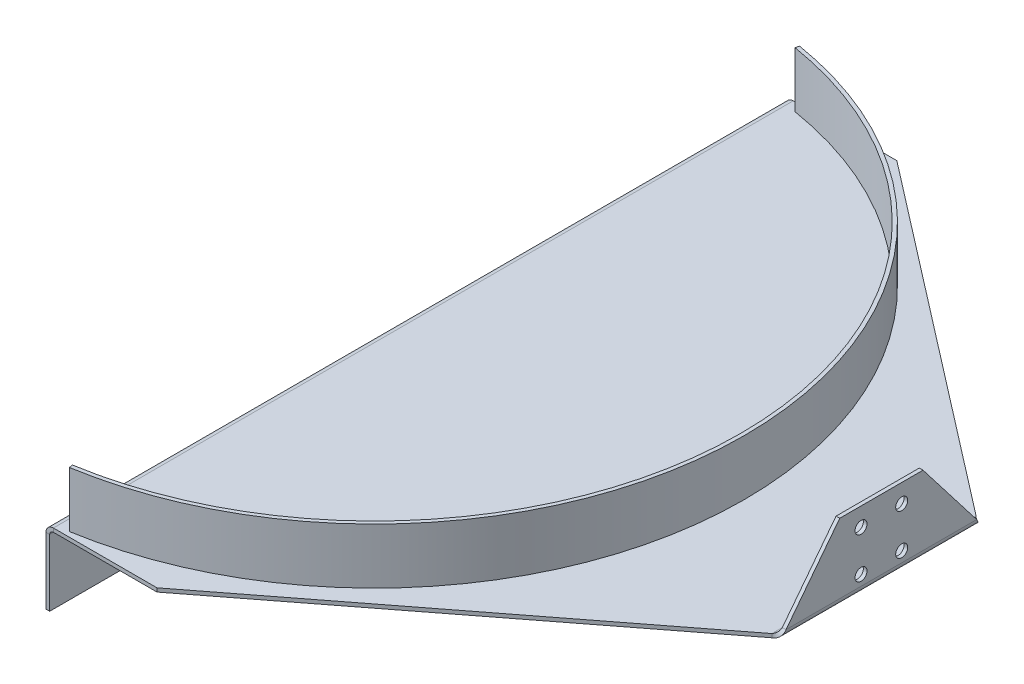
ISO-10303-21;
HEADER;
FILE_DESCRIPTION(('STEP AP214'),'2;1');
FILE_NAME('part.step','',(''),(''),'','','');
FILE_SCHEMA(('AUTOMOTIVE_DESIGN { 1 0 10303 214 1 1 1 1 }'));
ENDSEC;
DATA;
#1=APPLICATION_CONTEXT('core data for automotive mechanical design processes');
#2=APPLICATION_PROTOCOL_DEFINITION('international standard','automotive_design',2000,#1);
#3=PRODUCT_CONTEXT('',#1,'mechanical');
#4=PRODUCT('Part','Part','',(#3));
#5=PRODUCT_RELATED_PRODUCT_CATEGORY('part','',(#4));
#6=PRODUCT_DEFINITION_FORMATION('','',#4);
#7=PRODUCT_DEFINITION_CONTEXT('part definition',#1,'design');
#8=PRODUCT_DEFINITION('design','',#6,#7);
#9=PRODUCT_DEFINITION_SHAPE('','',#8);
#10=(LENGTH_UNIT() NAMED_UNIT(*) SI_UNIT(.MILLI.,.METRE.));
#11=(NAMED_UNIT(*) PLANE_ANGLE_UNIT() SI_UNIT($,.RADIAN.));
#12=(NAMED_UNIT(*) SI_UNIT($,.STERADIAN.) SOLID_ANGLE_UNIT());
#13=UNCERTAINTY_MEASURE_WITH_UNIT(LENGTH_MEASURE(1.E-05),#10,'distance_accuracy_value','');
#14=(GEOMETRIC_REPRESENTATION_CONTEXT(3) GLOBAL_UNCERTAINTY_ASSIGNED_CONTEXT((#13)) GLOBAL_UNIT_ASSIGNED_CONTEXT((#10,
#11,#12)) REPRESENTATION_CONTEXT('',''));
#15=CARTESIAN_POINT('',(0.,0.,0.));
#16=DIRECTION('',(0.,0.,1.));
#17=DIRECTION('',(1.,0.,0.));
#18=AXIS2_PLACEMENT_3D('',#15,#16,#17);
#19=CARTESIAN_POINT('',(0.,0.,200.));
#20=DIRECTION('',(0.,1.,0.));
#21=DIRECTION('',(0.,0.,1.));
#22=AXIS2_PLACEMENT_3D('',#19,#20,#21);
#23=PLANE('',#22);
#24=DIRECTION('',(0.,0.,1.));
#25=VECTOR('',#24,1.);
#26=CARTESIAN_POINT('',(247.643805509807,0.,200.));
#27=LINE('',#26,#25);
#28=CARTESIAN_POINT('',(247.643805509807,0.,-55.1879327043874));
#29=VERTEX_POINT('',#28);
#30=CARTESIAN_POINT('',(247.643805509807,0.,55.1879327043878));
#31=VERTEX_POINT('',#30);
#32=EDGE_CURVE('E414',#29,#31,#27,.T.);
#33=ORIENTED_EDGE('',*,*,#32,.F.);
#34=DIRECTION('',(0.791663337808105,0.,0.610957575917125));
#35=VECTOR('',#34,1.);
#36=CARTESIAN_POINT('',(60.,0.,-200.));
#37=LINE('',#36,#35);
#38=CARTESIAN_POINT('',(60.,0.,-200.));
#39=VERTEX_POINT('',#38);
#40=EDGE_CURVE('E368',#39,#29,#37,.T.);
#41=ORIENTED_EDGE('',*,*,#40,.F.);
#42=DIRECTION('',(1.,0.,0.));
#43=VECTOR('',#42,1.);
#44=CARTESIAN_POINT('',(0.,0.,-200.));
#45=LINE('',#44,#43);
#46=CARTESIAN_POINT('',(4.,0.,-200.));
#47=VERTEX_POINT('',#46);
#48=EDGE_CURVE('E364',#47,#39,#45,.T.);
#49=ORIENTED_EDGE('',*,*,#48,.F.);
#50=DIRECTION('',(0.,0.,-1.));
#51=VECTOR('',#50,1.);
#52=CARTESIAN_POINT('',(4.,0.,-200.));
#53=LINE('',#52,#51);
#54=CARTESIAN_POINT('',(4.,0.,200.));
#55=VERTEX_POINT('',#54);
#56=EDGE_CURVE('E367',#55,#47,#53,.T.);
#57=ORIENTED_EDGE('',*,*,#56,.F.);
#58=DIRECTION('',(-1.,0.,0.));
#59=VECTOR('',#58,1.);
#60=CARTESIAN_POINT('',(0.,0.,200.));
#61=LINE('',#60,#59);
#62=CARTESIAN_POINT('',(59.9999999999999,0.,200.));
#63=VERTEX_POINT('',#62);
#64=EDGE_CURVE('E393',#63,#55,#61,.T.);
#65=ORIENTED_EDGE('',*,*,#64,.F.);
#66=DIRECTION('',(-0.791663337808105,0.,0.610957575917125));
#67=VECTOR('',#66,1.);
#68=CARTESIAN_POINT('',(59.9999999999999,0.,200.));
#69=LINE('',#68,#67);
#70=EDGE_CURVE('E363',#31,#63,#69,.T.);
#71=ORIENTED_EDGE('',*,*,#70,.F.);
#72=EDGE_LOOP('',(#33,#41,#49,#57,#65,#71));
#73=FACE_BOUND('',#72,.T.);
#74=DIRECTION('',(-0.162499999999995,0.,-0.986708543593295));
#75=VECTOR('',#74,1.);
#76=CARTESIAN_POINT('',(9.99999999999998,0.,197.341708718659));
#77=LINE('',#76,#75);
#78=CARTESIAN_POINT('',(9.99999999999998,0.,197.341708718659));
#79=VERTEX_POINT('',#78);
#80=CARTESIAN_POINT('',(9.67499999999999,0.,195.368291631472));
#81=VERTEX_POINT('',#80);
#82=EDGE_CURVE('E50',#79,#81,#77,.T.);
#83=ORIENTED_EDGE('',*,*,#82,.T.);
#84=CARTESIAN_POINT('',(-22.5,0.,0.));
#85=DIRECTION('',(0.,1.,0.));
#86=DIRECTION('',(-1.,0.,0.));
#87=AXIS2_PLACEMENT_3D('',#84,#85,#86);
#88=CIRCLE('',#87,198.);
#89=CARTESIAN_POINT('',(9.67500000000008,0.,-195.368291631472));
#90=VERTEX_POINT('',#89);
#91=EDGE_CURVE('E157',#90,#81,#88,.F.);
#92=ORIENTED_EDGE('',*,*,#91,.F.);
#93=DIRECTION('',(0.162499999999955,0.,-0.986708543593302));
#94=VECTOR('',#93,1.);
#95=CARTESIAN_POINT('',(9.67500000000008,0.,-195.368291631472));
#96=LINE('',#95,#94);
#97=CARTESIAN_POINT('',(9.99999999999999,0.,-197.341708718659));
#98=VERTEX_POINT('',#97);
#99=EDGE_CURVE('E160',#90,#98,#96,.T.);
#100=ORIENTED_EDGE('',*,*,#99,.T.);
#101=CARTESIAN_POINT('',(-22.5,0.,0.));
#102=DIRECTION('',(0.,-1.,0.));
#103=DIRECTION('',(0.,0.,-1.));
#104=AXIS2_PLACEMENT_3D('',#101,#102,#103);
#105=CIRCLE('',#104,200.);
#106=EDGE_CURVE('E55',#98,#79,#105,.T.);
#107=ORIENTED_EDGE('',*,*,#106,.T.);
#108=EDGE_LOOP('',(#83,#92,#100,#107));
#109=FACE_BOUND('',#108,.T.);
#110=ADVANCED_FACE('F32',(#73,#109),#23,.T.);
#111=CARTESIAN_POINT('',(249.643805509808,-250.356194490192,200.));
#112=DIRECTION('',(-1.,0.,0.));
#113=DIRECTION('',(0.,0.,1.));
#114=AXIS2_PLACEMENT_3D('',#111,#112,#113);
#115=PLANE('',#114);
#116=CARTESIAN_POINT('',(249.643805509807,7.64380550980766,-11.0000000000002));
#117=DIRECTION('',(-1.,0.,0.));
#118=DIRECTION('',(0.,-1.,0.));
#119=AXIS2_PLACEMENT_3D('',#116,#117,#118);
#120=CIRCLE('',#119,3.25);
#121=CARTESIAN_POINT('',(249.643805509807,4.39380550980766,-11.0000000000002));
#122=VERTEX_POINT('',#121);
#123=EDGE_CURVE('E768',#122,#122,#120,.F.);
#124=ORIENTED_EDGE('',*,*,#123,.T.);
#125=EDGE_LOOP('',(#124));
#126=FACE_BOUND('',#125,.T.);
#127=CARTESIAN_POINT('',(249.643805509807,7.64380550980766,10.9999999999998));
#128=DIRECTION('',(-1.,0.,0.));
#129=DIRECTION('',(0.,-1.,0.));
#130=AXIS2_PLACEMENT_3D('',#127,#128,#129);
#131=CIRCLE('',#130,3.25);
#132=CARTESIAN_POINT('',(249.643805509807,4.39380550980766,10.9999999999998));
#133=VERTEX_POINT('',#132);
#134=EDGE_CURVE('E776',#133,#133,#131,.F.);
#135=ORIENTED_EDGE('',*,*,#134,.T.);
#136=EDGE_LOOP('',(#135));
#137=FACE_BOUND('',#136,.T.);
#138=CARTESIAN_POINT('',(249.643805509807,29.6438055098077,-11.));
#139=DIRECTION('',(-1.,0.,0.));
#140=DIRECTION('',(0.,-1.,0.));
#141=AXIS2_PLACEMENT_3D('',#138,#139,#140);
#142=CIRCLE('',#141,3.25);
#143=CARTESIAN_POINT('',(249.643805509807,26.3938055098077,-11.));
#144=VERTEX_POINT('',#143);
#145=EDGE_CURVE('E782',#144,#144,#142,.F.);
#146=ORIENTED_EDGE('',*,*,#145,.T.);
#147=EDGE_LOOP('',(#146));
#148=FACE_BOUND('',#147,.T.);
#149=CARTESIAN_POINT('',(249.643805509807,29.6438055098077,11.));
#150=DIRECTION('',(-1.,0.,0.));
#151=DIRECTION('',(0.,-1.,0.));
#152=AXIS2_PLACEMENT_3D('',#149,#150,#151);
#153=CIRCLE('',#152,3.25);
#154=CARTESIAN_POINT('',(249.643805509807,26.3938055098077,11.));
#155=VERTEX_POINT('',#154);
#156=EDGE_CURVE('E788',#155,#155,#153,.F.);
#157=ORIENTED_EDGE('',*,*,#156,.T.);
#158=EDGE_LOOP('',(#157));
#159=FACE_BOUND('',#158,.T.);
#160=DIRECTION('',(0.,0.791663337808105,0.610957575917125));
#161=VECTOR('',#160,1.);
#162=CARTESIAN_POINT('',(249.643805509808,-190.356194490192,-200.));
#163=LINE('',#162,#161);
#164=CARTESIAN_POINT('',(249.643805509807,2.00000000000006,-51.5511977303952));
#165=VERTEX_POINT('',#164);
#166=CARTESIAN_POINT('',(249.643805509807,39.6438055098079,-22.5));
#167=VERTEX_POINT('',#166);
#168=EDGE_CURVE('E479',#165,#167,#163,.T.);
#169=ORIENTED_EDGE('',*,*,#168,.F.);
#170=DIRECTION('',(0.,0.,1.));
#171=VECTOR('',#170,1.);
#172=CARTESIAN_POINT('',(249.643805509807,1.99999999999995,200.));
#173=LINE('',#172,#171);
#174=CARTESIAN_POINT('',(249.643805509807,2.00000000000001,51.5511977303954));
#175=VERTEX_POINT('',#174);
#176=EDGE_CURVE('E11',#165,#175,#173,.T.);
#177=ORIENTED_EDGE('',*,*,#176,.T.);
#178=DIRECTION('',(0.,-0.791663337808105,0.610957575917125));
#179=VECTOR('',#178,1.);
#180=CARTESIAN_POINT('',(249.643805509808,-190.356194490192,200.));
#181=LINE('',#180,#179);
#182=CARTESIAN_POINT('',(249.643805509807,39.6438055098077,22.5));
#183=VERTEX_POINT('',#182);
#184=EDGE_CURVE('E490',#183,#175,#181,.T.);
#185=ORIENTED_EDGE('',*,*,#184,.F.);
#186=DIRECTION('',(0.,0.,-1.));
#187=VECTOR('',#186,1.);
#188=CARTESIAN_POINT('',(249.643805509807,39.6438055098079,200.));
#189=LINE('',#188,#187);
#190=EDGE_CURVE('E485',#183,#167,#189,.T.);
#191=ORIENTED_EDGE('',*,*,#190,.T.);
#192=EDGE_LOOP('',(#169,#177,#185,#191));
#193=FACE_BOUND('',#192,.T.);
#194=ADVANCED_FACE('F436',(#126,#137,#148,#159,#193),#115,.T.);
#195=CARTESIAN_POINT('',(1235.09893920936,-190.356194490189,-200.));
#196=DIRECTION('',(0.,-0.610957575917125,0.791663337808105));
#197=DIRECTION('',(0.,-0.791663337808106,-0.610957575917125));
#198=AXIS2_PLACEMENT_3D('',#195,#196,#197);
#199=PLANE('',#198);
#200=CARTESIAN_POINT('',(249.643805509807,2.00000000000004,-51.551197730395));
#201=CARTESIAN_POINT('',(251.643805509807,2.00000000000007,-51.5511977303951));
#202=B_SPLINE_CURVE_WITH_KNOTS('',1,(#200,#201),.UNSPECIFIED.,.F.,.F.,(2,2),(0.,1.),.UNSPECIFIED.);
#203=CARTESIAN_POINT('',(251.643805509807,2.00000000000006,-51.5511977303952));
#204=VERTEX_POINT('',#203);
#205=EDGE_CURVE('E311',#165,#204,#202,.T.);
#206=ORIENTED_EDGE('',*,*,#205,.F.);
#207=ORIENTED_EDGE('',*,*,#168,.T.);
#208=DIRECTION('',(-1.,0.,0.));
#209=VECTOR('',#208,1.);
#210=CARTESIAN_POINT('',(1235.09893920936,39.6438055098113,-22.5));
#211=LINE('',#210,#209);
#212=CARTESIAN_POINT('',(251.643805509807,39.6438055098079,-22.5));
#213=VERTEX_POINT('',#212);
#214=EDGE_CURVE('E502',#213,#167,#211,.T.);
#215=ORIENTED_EDGE('',*,*,#214,.F.);
#216=DIRECTION('',(0.,0.791663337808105,0.610957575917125));
#217=VECTOR('',#216,1.);
#218=CARTESIAN_POINT('',(251.643805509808,-190.356194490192,-200.));
#219=LINE('',#218,#217);
#220=EDGE_CURVE('E465',#204,#213,#219,.T.);
#221=ORIENTED_EDGE('',*,*,#220,.F.);
#222=EDGE_LOOP('',(#206,#207,#215,#221));
#223=FACE_BOUND('',#222,.T.);
#224=ADVANCED_FACE('F34',(#223),#199,.F.);
#225=CARTESIAN_POINT('',(1235.09893920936,39.6438055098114,200.));
#226=DIRECTION('',(0.,1.,0.));
#227=DIRECTION('',(-1.,0.,0.));
#228=AXIS2_PLACEMENT_3D('',#225,#226,#227);
#229=PLANE('',#228);
#230=ORIENTED_EDGE('',*,*,#214,.T.);
#231=ORIENTED_EDGE('',*,*,#190,.F.);
#232=DIRECTION('',(-1.,0.,0.));
#233=VECTOR('',#232,1.);
#234=CARTESIAN_POINT('',(1235.09893920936,39.6438055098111,22.5));
#235=LINE('',#234,#233);
#236=CARTESIAN_POINT('',(251.643805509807,39.6438055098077,22.5));
#237=VERTEX_POINT('',#236);
#238=EDGE_CURVE('E470',#237,#183,#235,.T.);
#239=ORIENTED_EDGE('',*,*,#238,.F.);
#240=DIRECTION('',(0.,0.,-1.));
#241=VECTOR('',#240,1.);
#242=CARTESIAN_POINT('',(251.643805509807,39.6438055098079,200.));
#243=LINE('',#242,#241);
#244=EDGE_CURVE('E466',#237,#213,#243,.T.);
#245=ORIENTED_EDGE('',*,*,#244,.T.);
#246=EDGE_LOOP('',(#230,#231,#239,#245));
#247=FACE_BOUND('',#246,.T.);
#248=ADVANCED_FACE('F446',(#247),#229,.T.);
#249=CARTESIAN_POINT('',(1235.09893920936,-190.356194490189,200.));
#250=DIRECTION('',(0.,-0.610957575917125,-0.791663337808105));
#251=DIRECTION('',(0.,0.791663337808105,-0.610957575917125));
#252=AXIS2_PLACEMENT_3D('',#249,#250,#251);
#253=PLANE('',#252);
#254=CARTESIAN_POINT('',(251.643805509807,2.,51.5511977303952));
#255=CARTESIAN_POINT('',(249.643805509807,2.00000000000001,51.5511977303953));
#256=B_SPLINE_CURVE_WITH_KNOTS('',1,(#254,#255),.UNSPECIFIED.,.F.,.F.,(2,2),(0.,1.),.UNSPECIFIED.);
#257=CARTESIAN_POINT('',(251.643805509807,2.,51.5511977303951));
#258=VERTEX_POINT('',#257);
#259=EDGE_CURVE('E298',#258,#175,#256,.T.);
#260=ORIENTED_EDGE('',*,*,#259,.F.);
#261=DIRECTION('',(0.,-0.791663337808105,0.610957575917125));
#262=VECTOR('',#261,1.);
#263=CARTESIAN_POINT('',(251.643805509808,-190.356194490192,200.));
#264=LINE('',#263,#262);
#265=EDGE_CURVE('E462',#237,#258,#264,.T.);
#266=ORIENTED_EDGE('',*,*,#265,.F.);
#267=ORIENTED_EDGE('',*,*,#238,.T.);
#268=ORIENTED_EDGE('',*,*,#184,.T.);
#269=EDGE_LOOP('',(#260,#266,#267,#268));
#270=FACE_BOUND('',#269,.T.);
#271=ADVANCED_FACE('F442',(#270),#253,.F.);
#272=CARTESIAN_POINT('',(251.643805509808,-250.356194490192,200.));
#273=DIRECTION('',(-1.,0.,0.));
#274=DIRECTION('',(0.,0.,1.));
#275=AXIS2_PLACEMENT_3D('',#272,#273,#274);
#276=PLANE('',#275);
#277=CARTESIAN_POINT('',(251.643805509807,7.64380550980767,-11.0000000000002));
#278=DIRECTION('',(1.,0.,0.));
#279=DIRECTION('',(0.,1.,0.));
#280=AXIS2_PLACEMENT_3D('',#277,#278,#279);
#281=CIRCLE('',#280,3.25);
#282=CARTESIAN_POINT('',(251.643805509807,10.8938055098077,-11.0000000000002));
#283=VERTEX_POINT('',#282);
#284=EDGE_CURVE('E773',#283,#283,#281,.T.);
#285=ORIENTED_EDGE('',*,*,#284,.F.);
#286=EDGE_LOOP('',(#285));
#287=FACE_BOUND('',#286,.T.);
#288=CARTESIAN_POINT('',(251.643805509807,7.64380550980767,10.9999999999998));
#289=DIRECTION('',(1.,0.,0.));
#290=DIRECTION('',(0.,1.,0.));
#291=AXIS2_PLACEMENT_3D('',#288,#289,#290);
#292=CIRCLE('',#291,3.25);
#293=CARTESIAN_POINT('',(251.643805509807,10.8938055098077,10.9999999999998));
#294=VERTEX_POINT('',#293);
#295=EDGE_CURVE('E779',#294,#294,#292,.T.);
#296=ORIENTED_EDGE('',*,*,#295,.F.);
#297=EDGE_LOOP('',(#296));
#298=FACE_BOUND('',#297,.T.);
#299=CARTESIAN_POINT('',(251.643805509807,29.6438055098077,-11.));
#300=DIRECTION('',(1.,0.,0.));
#301=DIRECTION('',(0.,1.,0.));
#302=AXIS2_PLACEMENT_3D('',#299,#300,#301);
#303=CIRCLE('',#302,3.25);
#304=CARTESIAN_POINT('',(251.643805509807,32.8938055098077,-11.));
#305=VERTEX_POINT('',#304);
#306=EDGE_CURVE('E785',#305,#305,#303,.T.);
#307=ORIENTED_EDGE('',*,*,#306,.F.);
#308=EDGE_LOOP('',(#307));
#309=FACE_BOUND('',#308,.T.);
#310=CARTESIAN_POINT('',(251.643805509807,29.6438055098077,11.));
#311=DIRECTION('',(1.,0.,0.));
#312=DIRECTION('',(0.,1.,0.));
#313=AXIS2_PLACEMENT_3D('',#310,#311,#312);
#314=CIRCLE('',#313,3.25);
#315=CARTESIAN_POINT('',(251.643805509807,32.8938055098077,11.));
#316=VERTEX_POINT('',#315);
#317=EDGE_CURVE('E164',#316,#316,#314,.T.);
#318=ORIENTED_EDGE('',*,*,#317,.F.);
#319=EDGE_LOOP('',(#318));
#320=FACE_BOUND('',#319,.T.);
#321=DIRECTION('',(0.,0.,1.));
#322=VECTOR('',#321,1.);
#323=CARTESIAN_POINT('',(251.643805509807,1.99999999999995,200.));
#324=LINE('',#323,#322);
#325=EDGE_CURVE('E42',#204,#258,#324,.T.);
#326=ORIENTED_EDGE('',*,*,#325,.F.);
#327=ORIENTED_EDGE('',*,*,#220,.T.);
#328=ORIENTED_EDGE('',*,*,#244,.F.);
#329=ORIENTED_EDGE('',*,*,#265,.T.);
#330=EDGE_LOOP('',(#326,#327,#328,#329));
#331=FACE_BOUND('',#330,.T.);
#332=ADVANCED_FACE('F427',(#287,#298,#309,#320,#331),#276,.F.);
#333=CARTESIAN_POINT('',(60.,-985.45513369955,-200.));
#334=DIRECTION('',(-0.610957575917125,0.,0.791663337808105));
#335=DIRECTION('',(-0.791663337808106,0.,-0.610957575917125));
#336=AXIS2_PLACEMENT_3D('',#333,#334,#335);
#337=PLANE('',#336);
#338=ORIENTED_EDGE('',*,*,#40,.T.);
#339=CARTESIAN_POINT('',(247.643805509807,-1.99999999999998,-55.1879327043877));
#340=CARTESIAN_POINT('',(247.643805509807,0.,-55.1879327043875));
#341=B_SPLINE_CURVE_WITH_KNOTS('',1,(#339,#340),.UNSPECIFIED.,.F.,.F.,(2,2),(0.,1.),.UNSPECIFIED.);
#342=CARTESIAN_POINT('',(247.643805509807,-2.,-55.1879327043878));
#343=VERTEX_POINT('',#342);
#344=EDGE_CURVE('E409',#29,#343,#341,.F.);
#345=ORIENTED_EDGE('',*,*,#344,.T.);
#346=DIRECTION('',(0.791663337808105,0.,0.610957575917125));
#347=VECTOR('',#346,1.);
#348=CARTESIAN_POINT('',(60.,-2.,-200.));
#349=LINE('',#348,#347);
#350=CARTESIAN_POINT('',(60.,-2.00000000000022,-200.));
#351=VERTEX_POINT('',#350);
#352=EDGE_CURVE('E375',#351,#343,#349,.T.);
#353=ORIENTED_EDGE('',*,*,#352,.F.);
#354=DIRECTION('',(0.,1.,0.));
#355=VECTOR('',#354,1.);
#356=CARTESIAN_POINT('',(60.,-985.45513369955,-200.));
#357=LINE('',#356,#355);
#358=EDGE_CURVE('E384',#351,#39,#357,.T.);
#359=ORIENTED_EDGE('',*,*,#358,.T.);
#360=EDGE_LOOP('',(#338,#345,#353,#359));
#361=FACE_BOUND('',#360,.T.);
#362=ADVANCED_FACE('F416',(#361),#337,.F.);
#363=CARTESIAN_POINT('',(60.,-985.45513369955,200.));
#364=DIRECTION('',(-0.610957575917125,0.,-0.791663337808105));
#365=DIRECTION('',(0.791663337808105,0.,-0.610957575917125));
#366=AXIS2_PLACEMENT_3D('',#363,#364,#365);
#367=PLANE('',#366);
#368=DIRECTION('',(-0.791663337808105,0.,0.610957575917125));
#369=VECTOR('',#368,1.);
#370=CARTESIAN_POINT('',(59.9999999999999,-2.,200.));
#371=LINE('',#370,#369);
#372=CARTESIAN_POINT('',(247.643805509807,-1.99999999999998,55.1879327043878));
#373=VERTEX_POINT('',#372);
#374=CARTESIAN_POINT('',(60.,-2.00000000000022,200.));
#375=VERTEX_POINT('',#374);
#376=EDGE_CURVE('E371',#373,#375,#371,.T.);
#377=ORIENTED_EDGE('',*,*,#376,.F.);
#378=CARTESIAN_POINT('',(247.643805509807,0.,55.1879327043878));
#379=CARTESIAN_POINT('',(247.643805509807,-1.99999999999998,55.1879327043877));
#380=B_SPLINE_CURVE_WITH_KNOTS('',1,(#378,#379),.UNSPECIFIED.,.F.,.F.,(2,2),(0.,1.),.UNSPECIFIED.);
#381=EDGE_CURVE('E398',#373,#31,#380,.F.);
#382=ORIENTED_EDGE('',*,*,#381,.T.);
#383=ORIENTED_EDGE('',*,*,#70,.T.);
#384=DIRECTION('',(0.,1.,0.));
#385=VECTOR('',#384,1.);
#386=CARTESIAN_POINT('',(60.,-985.45513369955,200.));
#387=LINE('',#386,#385);
#388=EDGE_CURVE('E381',#375,#63,#387,.T.);
#389=ORIENTED_EDGE('',*,*,#388,.F.);
#390=EDGE_LOOP('',(#377,#382,#383,#389));
#391=FACE_BOUND('',#390,.T.);
#392=ADVANCED_FACE('F426',(#391),#367,.F.);
#393=CARTESIAN_POINT('',(0.,-2.,200.));
#394=DIRECTION('',(0.,1.,0.));
#395=DIRECTION('',(0.,0.,1.));
#396=AXIS2_PLACEMENT_3D('',#393,#394,#395);
#397=PLANE('',#396);
#398=ORIENTED_EDGE('',*,*,#352,.T.);
#399=DIRECTION('',(0.,0.,1.));
#400=VECTOR('',#399,1.);
#401=CARTESIAN_POINT('',(247.643805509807,-2.,200.));
#402=LINE('',#401,#400);
#403=EDGE_CURVE('E396',#343,#373,#402,.T.);
#404=ORIENTED_EDGE('',*,*,#403,.T.);
#405=ORIENTED_EDGE('',*,*,#376,.T.);
#406=DIRECTION('',(-1.,0.,0.));
#407=VECTOR('',#406,1.);
#408=CARTESIAN_POINT('',(0.,-2.,200.));
#409=LINE('',#408,#407);
#410=CARTESIAN_POINT('',(4.,-2.,200.));
#411=VERTEX_POINT('',#410);
#412=EDGE_CURVE('E390',#375,#411,#409,.T.);
#413=ORIENTED_EDGE('',*,*,#412,.T.);
#414=DIRECTION('',(0.,0.,-1.));
#415=VECTOR('',#414,1.);
#416=CARTESIAN_POINT('',(4.,-2.,-200.));
#417=LINE('',#416,#415);
#418=CARTESIAN_POINT('',(4.,-2.,-200.));
#419=VERTEX_POINT('',#418);
#420=EDGE_CURVE('E376',#411,#419,#417,.T.);
#421=ORIENTED_EDGE('',*,*,#420,.T.);
#422=DIRECTION('',(1.,0.,0.));
#423=VECTOR('',#422,1.);
#424=CARTESIAN_POINT('',(0.,-2.,-200.));
#425=LINE('',#424,#423);
#426=EDGE_CURVE('E372',#419,#351,#425,.T.);
#427=ORIENTED_EDGE('',*,*,#426,.T.);
#428=EDGE_LOOP('',(#398,#404,#405,#413,#421,#427));
#429=FACE_BOUND('',#428,.T.);
#430=ADVANCED_FACE('F434',(#429),#397,.F.);
#431=CARTESIAN_POINT('',(0.,-985.45513369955,-200.));
#432=DIRECTION('',(0.,0.,1.));
#433=DIRECTION('',(0.,-1.,0.));
#434=AXIS2_PLACEMENT_3D('',#431,#432,#433);
#435=PLANE('',#434);
#436=ORIENTED_EDGE('',*,*,#48,.T.);
#437=ORIENTED_EDGE('',*,*,#358,.F.);
#438=ORIENTED_EDGE('',*,*,#426,.F.);
#439=DIRECTION('',(0.,1.,0.));
#440=VECTOR('',#439,1.);
#441=CARTESIAN_POINT('',(4.,-985.45513369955,-200.));
#442=LINE('',#441,#440);
#443=EDGE_CURVE('E387',#419,#47,#442,.T.);
#444=ORIENTED_EDGE('',*,*,#443,.T.);
#445=EDGE_LOOP('',(#436,#437,#438,#444));
#446=FACE_BOUND('',#445,.T.);
#447=ADVANCED_FACE('F430',(#446),#435,.F.);
#448=CARTESIAN_POINT('',(0.,-985.45513369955,200.));
#449=DIRECTION('',(0.,0.,1.));
#450=DIRECTION('',(0.,-1.,0.));
#451=AXIS2_PLACEMENT_3D('',#448,#449,#450);
#452=PLANE('',#451);
#453=ORIENTED_EDGE('',*,*,#388,.T.);
#454=ORIENTED_EDGE('',*,*,#64,.T.);
#455=DIRECTION('',(0.,1.,0.));
#456=VECTOR('',#455,1.);
#457=CARTESIAN_POINT('',(4.,-985.45513369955,200.));
#458=LINE('',#457,#456);
#459=EDGE_CURVE('E379',#411,#55,#458,.T.);
#460=ORIENTED_EDGE('',*,*,#459,.F.);
#461=ORIENTED_EDGE('',*,*,#412,.F.);
#462=EDGE_LOOP('',(#453,#454,#460,#461));
#463=FACE_BOUND('',#462,.T.);
#464=ADVANCED_FACE('F433',(#463),#452,.T.);
#465=CARTESIAN_POINT('',(805.233465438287,-40.,-200.));
#466=DIRECTION('',(0.,0.,1.));
#467=DIRECTION('',(1.,0.,0.));
#468=AXIS2_PLACEMENT_3D('',#465,#466,#467);
#469=PLANE('',#468);
#470=DIRECTION('',(0.,1.,0.));
#471=VECTOR('',#470,1.);
#472=CARTESIAN_POINT('',(0.,-40.,-200.));
#473=LINE('',#472,#471);
#474=CARTESIAN_POINT('',(0.,-40.,-200.));
#475=VERTEX_POINT('',#474);
#476=CARTESIAN_POINT('',(0.,-4.,-200.));
#477=VERTEX_POINT('',#476);
#478=EDGE_CURVE('E331',#475,#477,#473,.T.);
#479=ORIENTED_EDGE('',*,*,#478,.T.);
#480=DIRECTION('',(-1.,0.,0.));
#481=VECTOR('',#480,1.);
#482=CARTESIAN_POINT('',(805.233465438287,-4.,-200.));
#483=LINE('',#482,#481);
#484=CARTESIAN_POINT('',(2.,-4.,-200.));
#485=VERTEX_POINT('',#484);
#486=EDGE_CURVE('E361',#485,#477,#483,.T.);
#487=ORIENTED_EDGE('',*,*,#486,.F.);
#488=DIRECTION('',(0.,1.,0.));
#489=VECTOR('',#488,1.);
#490=CARTESIAN_POINT('',(2.,-40.,-200.));
#491=LINE('',#490,#489);
#492=CARTESIAN_POINT('',(2.,-40.,-200.));
#493=VERTEX_POINT('',#492);
#494=EDGE_CURVE('E342',#493,#485,#491,.T.);
#495=ORIENTED_EDGE('',*,*,#494,.F.);
#496=DIRECTION('',(-1.,0.,0.));
#497=VECTOR('',#496,1.);
#498=CARTESIAN_POINT('',(805.233465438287,-40.,-200.));
#499=LINE('',#498,#497);
#500=EDGE_CURVE('E353',#493,#475,#499,.T.);
#501=ORIENTED_EDGE('',*,*,#500,.T.);
#502=EDGE_LOOP('',(#479,#487,#495,#501));
#503=FACE_BOUND('',#502,.T.);
#504=ADVANCED_FACE('F528',(#503),#469,.F.);
#505=CARTESIAN_POINT('',(805.233465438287,-40.,200.));
#506=DIRECTION('',(0.,0.,1.));
#507=DIRECTION('',(1.,0.,0.));
#508=AXIS2_PLACEMENT_3D('',#505,#506,#507);
#509=PLANE('',#508);
#510=DIRECTION('',(-1.,0.,0.));
#511=VECTOR('',#510,1.);
#512=CARTESIAN_POINT('',(805.233465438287,-4.,200.));
#513=LINE('',#512,#511);
#514=CARTESIAN_POINT('',(2.,-4.,200.));
#515=VERTEX_POINT('',#514);
#516=CARTESIAN_POINT('',(0.,-4.,200.));
#517=VERTEX_POINT('',#516);
#518=EDGE_CURVE('E358',#515,#517,#513,.T.);
#519=ORIENTED_EDGE('',*,*,#518,.T.);
#520=DIRECTION('',(0.,1.,0.));
#521=VECTOR('',#520,1.);
#522=CARTESIAN_POINT('',(0.,-40.,200.));
#523=LINE('',#522,#521);
#524=CARTESIAN_POINT('',(0.,-40.,200.));
#525=VERTEX_POINT('',#524);
#526=EDGE_CURVE('E336',#525,#517,#523,.T.);
#527=ORIENTED_EDGE('',*,*,#526,.F.);
#528=DIRECTION('',(-1.,0.,0.));
#529=VECTOR('',#528,1.);
#530=CARTESIAN_POINT('',(805.233465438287,-40.,200.));
#531=LINE('',#530,#529);
#532=CARTESIAN_POINT('',(2.,-40.,200.));
#533=VERTEX_POINT('',#532);
#534=EDGE_CURVE('E356',#533,#525,#531,.T.);
#535=ORIENTED_EDGE('',*,*,#534,.F.);
#536=DIRECTION('',(0.,1.,0.));
#537=VECTOR('',#536,1.);
#538=CARTESIAN_POINT('',(2.,-40.,200.));
#539=LINE('',#538,#537);
#540=EDGE_CURVE('E345',#533,#515,#539,.T.);
#541=ORIENTED_EDGE('',*,*,#540,.T.);
#542=EDGE_LOOP('',(#519,#527,#535,#541));
#543=FACE_BOUND('',#542,.T.);
#544=ADVANCED_FACE('F537',(#543),#509,.T.);
#545=CARTESIAN_POINT('',(805.233465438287,-40.,200.));
#546=DIRECTION('',(0.,1.,0.));
#547=DIRECTION('',(0.,0.,1.));
#548=AXIS2_PLACEMENT_3D('',#545,#546,#547);
#549=PLANE('',#548);
#550=DIRECTION('',(0.,0.,-1.));
#551=VECTOR('',#550,1.);
#552=CARTESIAN_POINT('',(0.,-40.,200.));
#553=LINE('',#552,#551);
#554=EDGE_CURVE('E334',#525,#475,#553,.T.);
#555=ORIENTED_EDGE('',*,*,#554,.T.);
#556=ORIENTED_EDGE('',*,*,#500,.F.);
#557=DIRECTION('',(0.,0.,-1.));
#558=VECTOR('',#557,1.);
#559=CARTESIAN_POINT('',(2.,-40.,200.));
#560=LINE('',#559,#558);
#561=EDGE_CURVE('E348',#533,#493,#560,.T.);
#562=ORIENTED_EDGE('',*,*,#561,.F.);
#563=ORIENTED_EDGE('',*,*,#534,.T.);
#564=EDGE_LOOP('',(#555,#556,#562,#563));
#565=FACE_BOUND('',#564,.T.);
#566=ADVANCED_FACE('F591',(#565),#549,.F.);
#567=CARTESIAN_POINT('',(2.,-40.,200.));
#568=DIRECTION('',(-1.,0.,0.));
#569=DIRECTION('',(0.,0.,1.));
#570=AXIS2_PLACEMENT_3D('',#567,#568,#569);
#571=PLANE('',#570);
#572=CARTESIAN_POINT('',(2.,-20.,-150.));
#573=DIRECTION('',(1.,0.,0.));
#574=DIRECTION('',(0.,0.,-1.));
#575=AXIS2_PLACEMENT_3D('',#572,#573,#574);
#576=CIRCLE('',#575,3.25000000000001);
#577=CARTESIAN_POINT('',(2.,-20.,-153.25));
#578=VERTEX_POINT('',#577);
#579=EDGE_CURVE('E754',#578,#578,#576,.T.);
#580=ORIENTED_EDGE('',*,*,#579,.F.);
#581=EDGE_LOOP('',(#580));
#582=FACE_BOUND('',#581,.T.);
#583=CARTESIAN_POINT('',(2.,-20.,0.));
#584=DIRECTION('',(1.,0.,0.));
#585=DIRECTION('',(0.,0.,-1.));
#586=AXIS2_PLACEMENT_3D('',#583,#584,#585);
#587=CIRCLE('',#586,3.25);
#588=CARTESIAN_POINT('',(2.,-20.,-3.25));
#589=VERTEX_POINT('',#588);
#590=EDGE_CURVE('E758',#589,#589,#587,.T.);
#591=ORIENTED_EDGE('',*,*,#590,.F.);
#592=EDGE_LOOP('',(#591));
#593=FACE_BOUND('',#592,.T.);
#594=CARTESIAN_POINT('',(2.,-20.,150.));
#595=DIRECTION('',(1.,0.,0.));
#596=DIRECTION('',(0.,0.,-1.));
#597=AXIS2_PLACEMENT_3D('',#594,#595,#596);
#598=CIRCLE('',#597,3.25000000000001);
#599=CARTESIAN_POINT('',(2.,-20.,146.75));
#600=VERTEX_POINT('',#599);
#601=EDGE_CURVE('E765',#600,#600,#598,.T.);
#602=ORIENTED_EDGE('',*,*,#601,.F.);
#603=EDGE_LOOP('',(#602));
#604=FACE_BOUND('',#603,.T.);
#605=DIRECTION('',(0.,0.,-1.));
#606=VECTOR('',#605,1.);
#607=CARTESIAN_POINT('',(2.,-4.,-200.));
#608=LINE('',#607,#606);
#609=EDGE_CURVE('E350',#515,#485,#608,.T.);
#610=ORIENTED_EDGE('',*,*,#609,.F.);
#611=ORIENTED_EDGE('',*,*,#540,.F.);
#612=ORIENTED_EDGE('',*,*,#561,.T.);
#613=ORIENTED_EDGE('',*,*,#494,.T.);
#614=EDGE_LOOP('',(#610,#611,#612,#613));
#615=FACE_BOUND('',#614,.T.);
#616=ADVANCED_FACE('F580',(#582,#593,#604,#615),#571,.F.);
#617=CARTESIAN_POINT('',(0.,-40.,200.));
#618=DIRECTION('',(-1.,0.,0.));
#619=DIRECTION('',(0.,0.,1.));
#620=AXIS2_PLACEMENT_3D('',#617,#618,#619);
#621=PLANE('',#620);
#622=CARTESIAN_POINT('',(0.,-20.,-150.));
#623=DIRECTION('',(-1.,0.,0.));
#624=DIRECTION('',(0.,0.,1.));
#625=AXIS2_PLACEMENT_3D('',#622,#623,#624);
#626=CIRCLE('',#625,3.25000000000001);
#627=CARTESIAN_POINT('',(0.,-20.,-146.75));
#628=VERTEX_POINT('',#627);
#629=EDGE_CURVE('E751',#628,#628,#626,.F.);
#630=ORIENTED_EDGE('',*,*,#629,.T.);
#631=EDGE_LOOP('',(#630));
#632=FACE_BOUND('',#631,.T.);
#633=CARTESIAN_POINT('',(0.,-20.,0.));
#634=DIRECTION('',(-1.,0.,0.));
#635=DIRECTION('',(0.,0.,1.));
#636=AXIS2_PLACEMENT_3D('',#633,#634,#635);
#637=CIRCLE('',#636,3.25);
#638=CARTESIAN_POINT('',(0.,-20.,3.25));
#639=VERTEX_POINT('',#638);
#640=EDGE_CURVE('E755',#639,#639,#637,.F.);
#641=ORIENTED_EDGE('',*,*,#640,.T.);
#642=EDGE_LOOP('',(#641));
#643=FACE_BOUND('',#642,.T.);
#644=CARTESIAN_POINT('',(0.,-20.,150.));
#645=DIRECTION('',(-1.,0.,0.));
#646=DIRECTION('',(0.,0.,1.));
#647=AXIS2_PLACEMENT_3D('',#644,#645,#646);
#648=CIRCLE('',#647,3.25000000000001);
#649=CARTESIAN_POINT('',(0.,-20.,153.25));
#650=VERTEX_POINT('',#649);
#651=EDGE_CURVE('E763',#650,#650,#648,.F.);
#652=ORIENTED_EDGE('',*,*,#651,.T.);
#653=EDGE_LOOP('',(#652));
#654=FACE_BOUND('',#653,.T.);
#655=ORIENTED_EDGE('',*,*,#526,.T.);
#656=DIRECTION('',(0.,0.,-1.));
#657=VECTOR('',#656,1.);
#658=CARTESIAN_POINT('',(0.,-4.,-200.));
#659=LINE('',#658,#657);
#660=EDGE_CURVE('E339',#517,#477,#659,.T.);
#661=ORIENTED_EDGE('',*,*,#660,.T.);
#662=ORIENTED_EDGE('',*,*,#478,.F.);
#663=ORIENTED_EDGE('',*,*,#554,.F.);
#664=EDGE_LOOP('',(#655,#661,#662,#663));
#665=FACE_BOUND('',#664,.T.);
#666=ADVANCED_FACE('F586',(#632,#643,#654,#665),#621,.T.);
#667=CARTESIAN_POINT('',(4.,-4.,-200.));
#668=DIRECTION('',(0.,0.,-1.));
#669=DIRECTION('',(-1.,0.,0.));
#670=AXIS2_PLACEMENT_3D('',#667,#668,#669);
#671=PLANE('',#670);
#672=ORIENTED_EDGE('',*,*,#443,.F.);
#673=CARTESIAN_POINT('',(4.,-4.,-200.));
#674=DIRECTION('',(0.,0.,1.));
#675=DIRECTION('',(1.,0.,0.));
#676=AXIS2_PLACEMENT_3D('',#673,#674,#675);
#677=CIRCLE('',#676,2.);
#678=EDGE_CURVE('E315',#419,#485,#677,.T.);
#679=ORIENTED_EDGE('',*,*,#678,.T.);
#680=ORIENTED_EDGE('',*,*,#486,.T.);
#681=CARTESIAN_POINT('',(4.,-4.,-200.));
#682=DIRECTION('',(0.,0.,1.));
#683=DIRECTION('',(1.,0.,0.));
#684=AXIS2_PLACEMENT_3D('',#681,#682,#683);
#685=CIRCLE('',#684,4.);
#686=EDGE_CURVE('E325',#47,#477,#685,.T.);
#687=ORIENTED_EDGE('',*,*,#686,.F.);
#688=EDGE_LOOP('',(#672,#679,#680,#687));
#689=FACE_BOUND('',#688,.T.);
#690=ADVANCED_FACE('F574',(#689),#671,.T.);
#691=CARTESIAN_POINT('',(4.,-4.,200.));
#692=DIRECTION('',(0.,0.,1.));
#693=DIRECTION('',(1.,0.,0.));
#694=AXIS2_PLACEMENT_3D('',#691,#692,#693);
#695=PLANE('',#694);
#696=CARTESIAN_POINT('',(4.,-4.,200.));
#697=DIRECTION('',(0.,0.,1.));
#698=DIRECTION('',(1.,0.,0.));
#699=AXIS2_PLACEMENT_3D('',#696,#697,#698);
#700=CIRCLE('',#699,2.);
#701=EDGE_CURVE('E322',#515,#411,#700,.F.);
#702=ORIENTED_EDGE('',*,*,#701,.T.);
#703=ORIENTED_EDGE('',*,*,#459,.T.);
#704=CARTESIAN_POINT('',(4.,-4.,200.));
#705=DIRECTION('',(0.,0.,1.));
#706=DIRECTION('',(1.,0.,0.));
#707=AXIS2_PLACEMENT_3D('',#704,#705,#706);
#708=CIRCLE('',#707,4.);
#709=EDGE_CURVE('E328',#517,#55,#708,.F.);
#710=ORIENTED_EDGE('',*,*,#709,.F.);
#711=ORIENTED_EDGE('',*,*,#518,.F.);
#712=EDGE_LOOP('',(#702,#703,#710,#711));
#713=FACE_BOUND('',#712,.T.);
#714=ADVANCED_FACE('F554',(#713),#695,.T.);
#715=CARTESIAN_POINT('',(4.,-4.,-716.473605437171));
#716=DIRECTION('',(0.,0.,1.));
#717=DIRECTION('',(1.,0.,0.));
#718=AXIS2_PLACEMENT_3D('',#715,#716,#717);
#719=CYLINDRICAL_SURFACE('',#718,4.);
#720=ORIENTED_EDGE('',*,*,#660,.F.);
#721=ORIENTED_EDGE('',*,*,#709,.T.);
#722=ORIENTED_EDGE('',*,*,#56,.T.);
#723=ORIENTED_EDGE('',*,*,#686,.T.);
#724=EDGE_LOOP('',(#720,#721,#722,#723));
#725=FACE_BOUND('',#724,.T.);
#726=ADVANCED_FACE('F552',(#725),#719,.T.);
#727=CARTESIAN_POINT('',(4.,-4.,-716.473605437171));
#728=DIRECTION('',(0.,0.,1.));
#729=DIRECTION('',(1.,0.,0.));
#730=AXIS2_PLACEMENT_3D('',#727,#728,#729);
#731=CYLINDRICAL_SURFACE('',#730,2.);
#732=ORIENTED_EDGE('',*,*,#609,.T.);
#733=ORIENTED_EDGE('',*,*,#678,.F.);
#734=ORIENTED_EDGE('',*,*,#420,.F.);
#735=ORIENTED_EDGE('',*,*,#701,.F.);
#736=EDGE_LOOP('',(#732,#733,#734,#735));
#737=FACE_BOUND('',#736,.T.);
#738=ADVANCED_FACE('F273',(#737),#731,.F.);
#739=CARTESIAN_POINT('',(251.643805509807,2.,51.5511977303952));
#740=CARTESIAN_POINT('',(251.643805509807,1.47633051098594,51.8542999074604));
#741=CARTESIAN_POINT('',(251.539696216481,0.953008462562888,52.1573202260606));
#742=CARTESIAN_POINT('',(251.138951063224,-0.0144759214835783,52.7634427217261));
#743=CARTESIAN_POINT('',(250.8424728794,-0.458186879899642,53.0665039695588));
#744=CARTESIAN_POINT('',(250.101992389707,-1.1986673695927,53.6726264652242));
#745=CARTESIAN_POINT('',(249.658281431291,-1.49514555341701,53.9756877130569));
#746=CARTESIAN_POINT('',(248.690797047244,-1.89589070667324,54.5818102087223));
#747=CARTESIAN_POINT('',(248.167474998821,-1.99999999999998,54.8848305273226));
#748=CARTESIAN_POINT('',(247.643805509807,-1.99999999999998,55.1879327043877));
#749=CARTESIAN_POINT('',(249.643805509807,2.00000000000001,51.5511977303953));
#750=CARTESIAN_POINT('',(249.643805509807,1.73818044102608,51.8542823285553));
#751=CARTESIAN_POINT('',(249.591750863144,1.47650423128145,52.1573202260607));
#752=CARTESIAN_POINT('',(249.391378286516,0.992762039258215,52.7634427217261));
#753=CARTESIAN_POINT('',(249.243139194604,0.77090656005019,53.0665039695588));
#754=CARTESIAN_POINT('',(248.872898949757,0.400666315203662,53.6726264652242));
#755=CARTESIAN_POINT('',(248.651043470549,0.252427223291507,53.975687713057));
#756=CARTESIAN_POINT('',(248.167301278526,0.0520546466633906,54.5818102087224));
#757=CARTESIAN_POINT('',(247.905625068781,0.,54.8848481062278));
#758=CARTESIAN_POINT('',(247.643805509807,0.,55.1879327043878));
#759=B_SPLINE_SURFACE_WITH_KNOTS('',1,3,((#739,#740,#741,#742,#743,#744,#745,#746,#747,#748),
(#749,#750,#751,#752,#753,#754,#755,#756,#757,#758)),.UNSPECIFIED.,.F.,.F.,.F.,(2,2),(4,2,2,2,
4),(0.,1.),(0.,0.25,0.5,0.75,1.),.UNSPECIFIED.);
#760=CARTESIAN_POINT('',(249.643805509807,2.00000000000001,51.5511977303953));
#761=CARTESIAN_POINT('',(249.643805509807,1.73818044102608,51.8542823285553));
#762=CARTESIAN_POINT('',(249.591750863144,1.47650423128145,52.1573202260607));
#763=CARTESIAN_POINT('',(249.391378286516,0.992762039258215,52.7634427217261));
#764=CARTESIAN_POINT('',(249.243139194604,0.77090656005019,53.0665039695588));
#765=CARTESIAN_POINT('',(248.872898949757,0.400666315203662,53.6726264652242));
#766=CARTESIAN_POINT('',(248.651043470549,0.252427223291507,53.975687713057));
#767=CARTESIAN_POINT('',(248.167301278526,0.0520546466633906,54.5818102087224));
#768=CARTESIAN_POINT('',(247.905625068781,0.,54.8848481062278));
#769=CARTESIAN_POINT('',(247.643805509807,0.,55.1879327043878));
#770=B_SPLINE_CURVE_WITH_KNOTS('',3,(#760,#761,#762,#763,#764,#765,#766,#767,#768,#769),
.UNSPECIFIED.,.F.,.F.,(4,2,2,2,4),(0.,0.25,0.5,0.75,1.),.UNSPECIFIED.);
#771=EDGE_CURVE('E246',#175,#31,#770,.T.);
#772=CARTESIAN_POINT('',(247.643805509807,-1.99999999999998,55.1879327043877));
#773=CARTESIAN_POINT('',(248.167474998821,-1.99999999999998,54.8848305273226));
#774=CARTESIAN_POINT('',(248.690797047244,-1.89589070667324,54.5818102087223));
#775=CARTESIAN_POINT('',(249.658281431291,-1.49514555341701,53.9756877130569));
#776=CARTESIAN_POINT('',(250.101992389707,-1.1986673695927,53.6726264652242));
#777=CARTESIAN_POINT('',(250.8424728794,-0.458186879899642,53.0665039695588));
#778=CARTESIAN_POINT('',(251.138951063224,-0.0144759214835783,52.7634427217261));
#779=CARTESIAN_POINT('',(251.539696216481,0.953008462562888,52.1573202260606));
#780=CARTESIAN_POINT('',(251.643805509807,1.47633051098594,51.8542999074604));
#781=CARTESIAN_POINT('',(251.643805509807,2.,51.5511977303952));
#782=B_SPLINE_CURVE_WITH_KNOTS('',3,(#772,#773,#774,#775,#776,#777,#778,#779,#780,#781),
.UNSPECIFIED.,.F.,.F.,(4,2,2,2,4),(0.,0.25,0.5,0.75,1.),.UNSPECIFIED.);
#783=EDGE_CURVE('E239',#258,#373,#782,.F.);
#784=ORIENTED_EDGE('',*,*,#259,.T.);
#785=ORIENTED_EDGE('',*,*,#771,.T.);
#786=ORIENTED_EDGE('',*,*,#381,.F.);
#787=ORIENTED_EDGE('',*,*,#783,.F.);
#788=EDGE_LOOP('',(#784,#785,#786,#787));
#789=FACE_BOUND('',#788,.T.);
#790=ADVANCED_FACE('F262',(#789),#759,.T.);
#791=CARTESIAN_POINT('',(247.643805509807,-1.99999999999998,-55.1879327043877));
#792=CARTESIAN_POINT('',(248.167474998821,-1.99999999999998,-54.8848305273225));
#793=CARTESIAN_POINT('',(248.690797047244,-1.89589070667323,-54.5818102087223));
#794=CARTESIAN_POINT('',(249.658281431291,-1.49514555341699,-53.9756877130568));
#795=CARTESIAN_POINT('',(250.101992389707,-1.19866736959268,-53.6726264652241));
#796=CARTESIAN_POINT('',(250.8424728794,-0.458186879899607,-53.0665039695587));
#797=CARTESIAN_POINT('',(251.138951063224,-0.0144759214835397,-52.763442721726));
#798=CARTESIAN_POINT('',(251.539696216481,0.953008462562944,-52.1573202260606));
#799=CARTESIAN_POINT('',(251.643805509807,1.47633051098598,-51.8542999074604));
#800=CARTESIAN_POINT('',(251.643805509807,2.00000000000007,-51.5511977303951));
#801=CARTESIAN_POINT('',(247.643805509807,0.,-55.1879327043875));
#802=CARTESIAN_POINT('',(247.905625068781,0.,-54.8848481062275));
#803=CARTESIAN_POINT('',(248.167301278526,0.0520546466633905,-54.5818102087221));
#804=CARTESIAN_POINT('',(248.651043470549,0.252427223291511,-53.9756877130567));
#805=CARTESIAN_POINT('',(248.872898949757,0.40066631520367,-53.672626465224));
#806=CARTESIAN_POINT('',(249.243139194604,0.770906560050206,-53.0665039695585));
#807=CARTESIAN_POINT('',(249.391378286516,0.992762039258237,-52.7634427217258));
#808=CARTESIAN_POINT('',(249.591750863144,1.47650423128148,-52.1573202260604));
#809=CARTESIAN_POINT('',(249.643805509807,1.73818044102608,-51.8542823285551));
#810=CARTESIAN_POINT('',(249.643805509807,2.00000000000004,-51.551197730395));
#811=B_SPLINE_SURFACE_WITH_KNOTS('',1,3,((#791,#792,#793,#794,#795,#796,#797,#798,#799,#800),
(#801,#802,#803,#804,#805,#806,#807,#808,#809,#810)),.UNSPECIFIED.,.F.,.F.,.F.,(2,2),(4,2,2,2,
4),(0.,1.),(0.,0.25,0.5,0.75,1.),.UNSPECIFIED.);
#812=CARTESIAN_POINT('',(247.643805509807,0.,-55.1879327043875));
#813=CARTESIAN_POINT('',(247.905625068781,0.,-54.8848481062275));
#814=CARTESIAN_POINT('',(248.167301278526,0.0520546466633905,-54.5818102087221));
#815=CARTESIAN_POINT('',(248.651043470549,0.252427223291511,-53.9756877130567));
#816=CARTESIAN_POINT('',(248.872898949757,0.40066631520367,-53.672626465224));
#817=CARTESIAN_POINT('',(249.243139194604,0.770906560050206,-53.0665039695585));
#818=CARTESIAN_POINT('',(249.391378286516,0.992762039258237,-52.7634427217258));
#819=CARTESIAN_POINT('',(249.591750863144,1.47650423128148,-52.1573202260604));
#820=CARTESIAN_POINT('',(249.643805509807,1.73818044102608,-51.8542823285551));
#821=CARTESIAN_POINT('',(249.643805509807,2.00000000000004,-51.551197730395));
#822=B_SPLINE_CURVE_WITH_KNOTS('',3,(#812,#813,#814,#815,#816,#817,#818,#819,#820,#821),
.UNSPECIFIED.,.F.,.F.,(4,2,2,2,4),(0.,0.25,0.5,0.75,1.),.UNSPECIFIED.);
#823=EDGE_CURVE('E194',#29,#165,#822,.T.);
#824=CARTESIAN_POINT('',(251.643805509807,2.00000000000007,-51.5511977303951));
#825=CARTESIAN_POINT('',(251.643805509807,1.47633051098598,-51.8542999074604));
#826=CARTESIAN_POINT('',(251.539696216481,0.953008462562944,-52.1573202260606));
#827=CARTESIAN_POINT('',(251.138951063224,-0.0144759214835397,-52.763442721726));
#828=CARTESIAN_POINT('',(250.8424728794,-0.458186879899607,-53.0665039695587));
#829=CARTESIAN_POINT('',(250.101992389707,-1.19866736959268,-53.6726264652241));
#830=CARTESIAN_POINT('',(249.658281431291,-1.49514555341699,-53.9756877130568));
#831=CARTESIAN_POINT('',(248.690797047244,-1.89589070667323,-54.5818102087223));
#832=CARTESIAN_POINT('',(248.167474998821,-1.99999999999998,-54.8848305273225));
#833=CARTESIAN_POINT('',(247.643805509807,-1.99999999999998,-55.1879327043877));
#834=B_SPLINE_CURVE_WITH_KNOTS('',3,(#824,#825,#826,#827,#828,#829,#830,#831,#832,#833),
.UNSPECIFIED.,.F.,.F.,(4,2,2,2,4),(0.,0.25,0.5,0.75,1.),.UNSPECIFIED.);
#835=EDGE_CURVE('E510',#343,#204,#834,.F.);
#836=ORIENTED_EDGE('',*,*,#344,.F.);
#837=ORIENTED_EDGE('',*,*,#823,.T.);
#838=ORIENTED_EDGE('',*,*,#205,.T.);
#839=ORIENTED_EDGE('',*,*,#835,.F.);
#840=EDGE_LOOP('',(#836,#837,#838,#839));
#841=FACE_BOUND('',#840,.T.);
#842=ADVANCED_FACE('F212',(#841),#811,.T.);
#843=CARTESIAN_POINT('',(247.643805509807,2.00000000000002,549.050914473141));
#844=DIRECTION('',(0.,0.,-1.));
#845=DIRECTION('',(-1.,0.,0.));
#846=AXIS2_PLACEMENT_3D('',#843,#844,#845);
#847=CYLINDRICAL_SURFACE('',#846,4.);
#848=ORIENTED_EDGE('',*,*,#835,.T.);
#849=ORIENTED_EDGE('',*,*,#325,.T.);
#850=ORIENTED_EDGE('',*,*,#783,.T.);
#851=ORIENTED_EDGE('',*,*,#403,.F.);
#852=EDGE_LOOP('',(#848,#849,#850,#851));
#853=FACE_BOUND('',#852,.T.);
#854=ADVANCED_FACE('F201',(#853),#847,.T.);
#855=CARTESIAN_POINT('',(247.643805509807,2.00000000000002,549.050914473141));
#856=DIRECTION('',(0.,0.,-1.));
#857=DIRECTION('',(-1.,0.,0.));
#858=AXIS2_PLACEMENT_3D('',#855,#856,#857);
#859=CYLINDRICAL_SURFACE('',#858,2.);
#860=ORIENTED_EDGE('',*,*,#823,.F.);
#861=ORIENTED_EDGE('',*,*,#32,.T.);
#862=ORIENTED_EDGE('',*,*,#771,.F.);
#863=ORIENTED_EDGE('',*,*,#176,.F.);
#864=EDGE_LOOP('',(#860,#861,#862,#863));
#865=FACE_BOUND('',#864,.T.);
#866=ADVANCED_FACE('F211',(#865),#859,.F.);
#867=CARTESIAN_POINT('',(-22.5,30.,0.));
#868=DIRECTION('',(0.,-1.,0.));
#869=DIRECTION('',(0.,0.,-1.));
#870=AXIS2_PLACEMENT_3D('',#867,#868,#869);
#871=CYLINDRICAL_SURFACE('',#870,198.);
#872=ORIENTED_EDGE('',*,*,#91,.T.);
#873=DIRECTION('',(0.,-1.,0.));
#874=VECTOR('',#873,1.);
#875=CARTESIAN_POINT('',(9.67499999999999,30.,195.368291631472));
#876=LINE('',#875,#874);
#877=CARTESIAN_POINT('',(9.67499999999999,30.,195.368291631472));
#878=VERTEX_POINT('',#877);
#879=EDGE_CURVE('E192',#878,#81,#876,.T.);
#880=ORIENTED_EDGE('',*,*,#879,.F.);
#881=CARTESIAN_POINT('',(-22.5,30.,0.));
#882=DIRECTION('',(0.,1.,0.));
#883=DIRECTION('',(-1.,0.,0.));
#884=AXIS2_PLACEMENT_3D('',#881,#882,#883);
#885=CIRCLE('',#884,198.);
#886=CARTESIAN_POINT('',(9.67500000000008,30.,-195.368291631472));
#887=VERTEX_POINT('',#886);
#888=EDGE_CURVE('E169',#887,#878,#885,.F.);
#889=ORIENTED_EDGE('',*,*,#888,.F.);
#890=DIRECTION('',(0.,-1.,0.));
#891=VECTOR('',#890,1.);
#892=CARTESIAN_POINT('',(9.67500000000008,30.,-195.368291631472));
#893=LINE('',#892,#891);
#894=EDGE_CURVE('E167',#887,#90,#893,.T.);
#895=ORIENTED_EDGE('',*,*,#894,.T.);
#896=EDGE_LOOP('',(#872,#880,#889,#895));
#897=FACE_BOUND('',#896,.T.);
#898=ADVANCED_FACE('F168',(#897),#871,.F.);
#899=CARTESIAN_POINT('',(9.99999999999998,30.,197.341708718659));
#900=DIRECTION('',(-0.986708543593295,0.,0.162499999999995));
#901=DIRECTION('',(0.162499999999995,0.,0.986708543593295));
#902=AXIS2_PLACEMENT_3D('',#899,#900,#901);
#903=PLANE('',#902);
#904=ORIENTED_EDGE('',*,*,#82,.F.);
#905=DIRECTION('',(0.,-1.,0.));
#906=VECTOR('',#905,1.);
#907=CARTESIAN_POINT('',(9.99999999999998,30.,197.341708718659));
#908=LINE('',#907,#906);
#909=CARTESIAN_POINT('',(9.99999999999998,30.,197.341708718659));
#910=VERTEX_POINT('',#909);
#911=EDGE_CURVE('E190',#910,#79,#908,.T.);
#912=ORIENTED_EDGE('',*,*,#911,.F.);
#913=DIRECTION('',(-0.162499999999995,0.,-0.986708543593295));
#914=VECTOR('',#913,1.);
#915=CARTESIAN_POINT('',(9.99999999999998,30.,197.341708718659));
#916=LINE('',#915,#914);
#917=EDGE_CURVE('E178',#910,#878,#916,.T.);
#918=ORIENTED_EDGE('',*,*,#917,.T.);
#919=ORIENTED_EDGE('',*,*,#879,.T.);
#920=EDGE_LOOP('',(#904,#912,#918,#919));
#921=FACE_BOUND('',#920,.T.);
#922=ADVANCED_FACE('F520',(#921),#903,.T.);
#923=CARTESIAN_POINT('',(-22.5,30.,0.));
#924=DIRECTION('',(0.,-1.,0.));
#925=DIRECTION('',(0.,0.,-1.));
#926=AXIS2_PLACEMENT_3D('',#923,#924,#925);
#927=CYLINDRICAL_SURFACE('',#926,200.);
#928=ORIENTED_EDGE('',*,*,#106,.F.);
#929=DIRECTION('',(0.,-1.,0.));
#930=VECTOR('',#929,1.);
#931=CARTESIAN_POINT('',(9.99999999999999,30.,-197.341708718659));
#932=LINE('',#931,#930);
#933=CARTESIAN_POINT('',(9.99999999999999,30.,-197.341708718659));
#934=VERTEX_POINT('',#933);
#935=EDGE_CURVE('E173',#934,#98,#932,.T.);
#936=ORIENTED_EDGE('',*,*,#935,.F.);
#937=CARTESIAN_POINT('',(-22.5,30.,0.));
#938=DIRECTION('',(0.,-1.,0.));
#939=DIRECTION('',(0.,0.,-1.));
#940=AXIS2_PLACEMENT_3D('',#937,#938,#939);
#941=CIRCLE('',#940,200.);
#942=EDGE_CURVE('E185',#934,#910,#941,.T.);
#943=ORIENTED_EDGE('',*,*,#942,.T.);
#944=ORIENTED_EDGE('',*,*,#911,.T.);
#945=EDGE_LOOP('',(#928,#936,#943,#944));
#946=FACE_BOUND('',#945,.T.);
#947=ADVANCED_FACE('F646',(#946),#927,.T.);
#948=CARTESIAN_POINT('',(9.67500000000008,30.,-195.368291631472));
#949=DIRECTION('',(-0.986708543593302,0.,-0.162499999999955));
#950=DIRECTION('',(-0.162499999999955,0.,0.986708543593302));
#951=AXIS2_PLACEMENT_3D('',#948,#949,#950);
#952=PLANE('',#951);
#953=ORIENTED_EDGE('',*,*,#99,.F.);
#954=ORIENTED_EDGE('',*,*,#894,.F.);
#955=DIRECTION('',(0.162499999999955,0.,-0.986708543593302));
#956=VECTOR('',#955,1.);
#957=CARTESIAN_POINT('',(9.67500000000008,30.,-195.368291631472));
#958=LINE('',#957,#956);
#959=EDGE_CURVE('E174',#887,#934,#958,.T.);
#960=ORIENTED_EDGE('',*,*,#959,.T.);
#961=ORIENTED_EDGE('',*,*,#935,.T.);
#962=EDGE_LOOP('',(#953,#954,#960,#961));
#963=FACE_BOUND('',#962,.T.);
#964=ADVANCED_FACE('F176',(#963),#952,.T.);
#965=CARTESIAN_POINT('',(-22.5,30.,0.));
#966=DIRECTION('',(0.,1.,0.));
#967=DIRECTION('',(0.,0.,1.));
#968=AXIS2_PLACEMENT_3D('',#965,#966,#967);
#969=PLANE('',#968);
#970=ORIENTED_EDGE('',*,*,#888,.T.);
#971=ORIENTED_EDGE('',*,*,#917,.F.);
#972=ORIENTED_EDGE('',*,*,#942,.F.);
#973=ORIENTED_EDGE('',*,*,#959,.F.);
#974=EDGE_LOOP('',(#970,#971,#972,#973));
#975=FACE_BOUND('',#974,.T.);
#976=ADVANCED_FACE('F665',(#975),#969,.T.);
#977=CARTESIAN_POINT('',(-0.0010000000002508,29.6438055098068,11.));
#978=DIRECTION('',(1.,0.,0.));
#979=DIRECTION('',(0.,1.,0.));
#980=AXIS2_PLACEMENT_3D('',#977,#978,#979);
#981=CYLINDRICAL_SURFACE('',#980,3.25);
#982=ORIENTED_EDGE('',*,*,#156,.F.);
#983=EDGE_LOOP('',(#982));
#984=FACE_BOUND('',#983,.T.);
#985=ORIENTED_EDGE('',*,*,#317,.T.);
#986=EDGE_LOOP('',(#985));
#987=FACE_BOUND('',#986,.T.);
#988=ADVANCED_FACE('F674',(#984,#987),#981,.F.);
#989=CARTESIAN_POINT('',(-0.0010000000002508,29.6438055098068,-11.));
#990=DIRECTION('',(1.,0.,0.));
#991=DIRECTION('',(0.,1.,0.));
#992=AXIS2_PLACEMENT_3D('',#989,#990,#991);
#993=CYLINDRICAL_SURFACE('',#992,3.25);
#994=ORIENTED_EDGE('',*,*,#145,.F.);
#995=EDGE_LOOP('',(#994));
#996=FACE_BOUND('',#995,.T.);
#997=ORIENTED_EDGE('',*,*,#306,.T.);
#998=EDGE_LOOP('',(#997));
#999=FACE_BOUND('',#998,.T.);
#1000=ADVANCED_FACE('F684',(#996,#999),#993,.F.);
#1001=CARTESIAN_POINT('',(-0.00100000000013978,7.64380550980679,10.9999999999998));
#1002=DIRECTION('',(1.,0.,0.));
#1003=DIRECTION('',(0.,1.,0.));
#1004=AXIS2_PLACEMENT_3D('',#1001,#1002,#1003);
#1005=CYLINDRICAL_SURFACE('',#1004,3.25);
#1006=ORIENTED_EDGE('',*,*,#134,.F.);
#1007=EDGE_LOOP('',(#1006));
#1008=FACE_BOUND('',#1007,.T.);
#1009=ORIENTED_EDGE('',*,*,#295,.T.);
#1010=EDGE_LOOP('',(#1009));
#1011=FACE_BOUND('',#1010,.T.);
#1012=ADVANCED_FACE('F694',(#1008,#1011),#1005,.F.);
#1013=CARTESIAN_POINT('',(-0.00100000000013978,7.64380550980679,-11.0000000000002));
#1014=DIRECTION('',(1.,0.,0.));
#1015=DIRECTION('',(0.,1.,0.));
#1016=AXIS2_PLACEMENT_3D('',#1013,#1014,#1015);
#1017=CYLINDRICAL_SURFACE('',#1016,3.25);
#1018=ORIENTED_EDGE('',*,*,#123,.F.);
#1019=EDGE_LOOP('',(#1018));
#1020=FACE_BOUND('',#1019,.T.);
#1021=ORIENTED_EDGE('',*,*,#284,.T.);
#1022=EDGE_LOOP('',(#1021));
#1023=FACE_BOUND('',#1022,.T.);
#1024=ADVANCED_FACE('F704',(#1020,#1023),#1017,.F.);
#1025=CARTESIAN_POINT('',(-0.00100000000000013,-20.,150.));
#1026=DIRECTION('',(1.,0.,0.));
#1027=DIRECTION('',(0.,0.,-1.));
#1028=AXIS2_PLACEMENT_3D('',#1025,#1026,#1027);
#1029=CYLINDRICAL_SURFACE('',#1028,3.25000000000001);
#1030=ORIENTED_EDGE('',*,*,#651,.F.);
#1031=EDGE_LOOP('',(#1030));
#1032=FACE_BOUND('',#1031,.T.);
#1033=ORIENTED_EDGE('',*,*,#601,.T.);
#1034=EDGE_LOOP('',(#1033));
#1035=FACE_BOUND('',#1034,.T.);
#1036=ADVANCED_FACE('F714',(#1032,#1035),#1029,.F.);
#1037=CARTESIAN_POINT('',(-0.00100000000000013,-20.,0.));
#1038=DIRECTION('',(1.,0.,0.));
#1039=DIRECTION('',(0.,0.,-1.));
#1040=AXIS2_PLACEMENT_3D('',#1037,#1038,#1039);
#1041=CYLINDRICAL_SURFACE('',#1040,3.25);
#1042=ORIENTED_EDGE('',*,*,#640,.F.);
#1043=EDGE_LOOP('',(#1042));
#1044=FACE_BOUND('',#1043,.T.);
#1045=ORIENTED_EDGE('',*,*,#590,.T.);
#1046=EDGE_LOOP('',(#1045));
#1047=FACE_BOUND('',#1046,.T.);
#1048=ADVANCED_FACE('F724',(#1044,#1047),#1041,.F.);
#1049=CARTESIAN_POINT('',(-0.00100000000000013,-20.,-150.));
#1050=DIRECTION('',(1.,0.,0.));
#1051=DIRECTION('',(0.,0.,-1.));
#1052=AXIS2_PLACEMENT_3D('',#1049,#1050,#1051);
#1053=CYLINDRICAL_SURFACE('',#1052,3.25000000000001);
#1054=ORIENTED_EDGE('',*,*,#629,.F.);
#1055=EDGE_LOOP('',(#1054));
#1056=FACE_BOUND('',#1055,.T.);
#1057=ORIENTED_EDGE('',*,*,#579,.T.);
#1058=EDGE_LOOP('',(#1057));
#1059=FACE_BOUND('',#1058,.T.);
#1060=ADVANCED_FACE('F734',(#1056,#1059),#1053,.F.);
#1061=CLOSED_SHELL('',(#110,#194,#224,#248,#271,#332,#362,#392,#430,#447,#464,#504,#544,#566,
#616,#666,#690,#714,#726,#738,#790,#842,#854,#866,#898,#922,#947,#964,#976,#988,#1000,#1012,
#1024,#1036,#1048,#1060));
#1062=MANIFOLD_SOLID_BREP('B2',#1061);
#1063=ADVANCED_BREP_SHAPE_REPRESENTATION('',(#18,#1062),#14);
#1064=SHAPE_DEFINITION_REPRESENTATION(#9,#1063);
ENDSEC;
END-ISO-10303-21;
